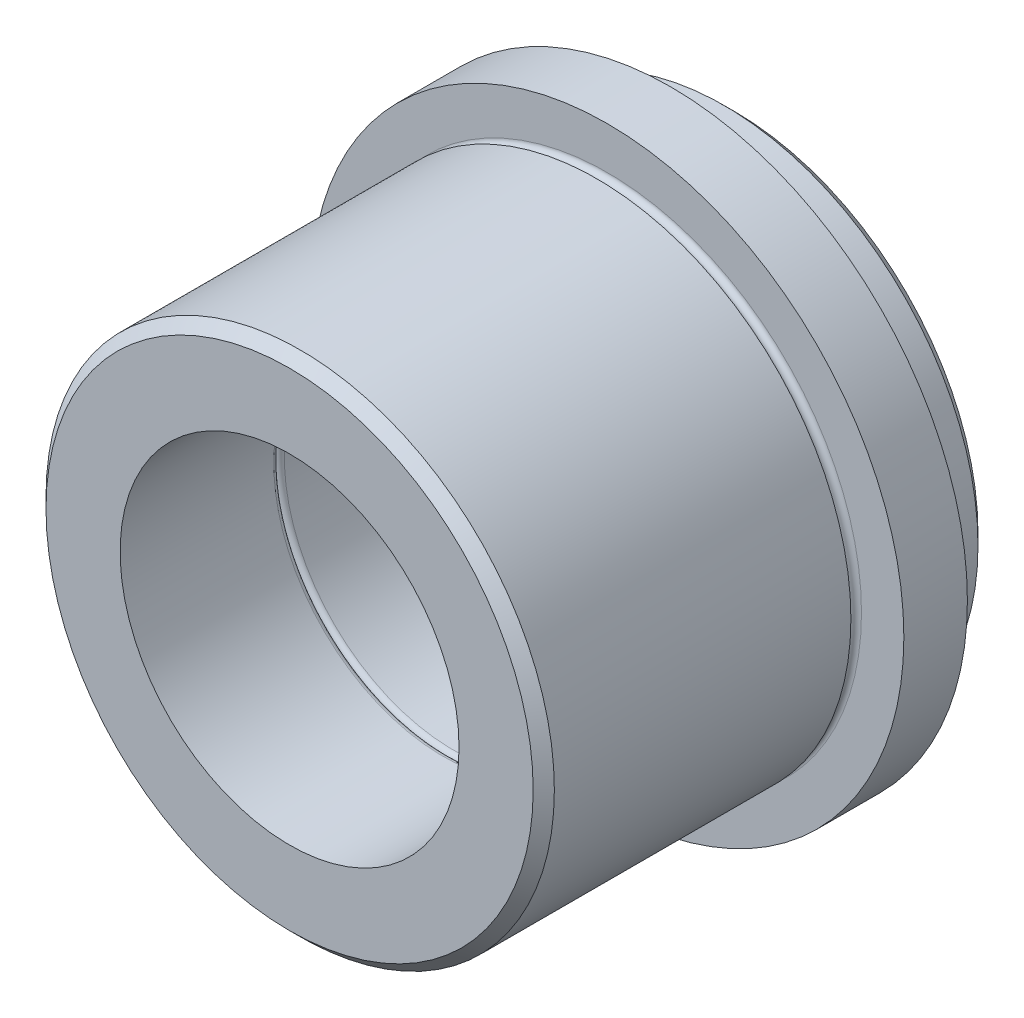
ISO-10303-21;
HEADER;
FILE_DESCRIPTION(('STEP AP214'),'2;1');
FILE_NAME('part.step','',(''),(''),'','','');
FILE_SCHEMA(('AUTOMOTIVE_DESIGN { 1 0 10303 214 1 1 1 1 }'));
ENDSEC;
DATA;
#1=APPLICATION_CONTEXT('core data for automotive mechanical design processes');
#2=APPLICATION_PROTOCOL_DEFINITION('international standard','automotive_design',2000,#1);
#3=PRODUCT_CONTEXT('',#1,'mechanical');
#4=PRODUCT('Part','Part','',(#3));
#5=PRODUCT_RELATED_PRODUCT_CATEGORY('part','',(#4));
#6=PRODUCT_DEFINITION_FORMATION('','',#4);
#7=PRODUCT_DEFINITION_CONTEXT('part definition',#1,'design');
#8=PRODUCT_DEFINITION('design','',#6,#7);
#9=PRODUCT_DEFINITION_SHAPE('','',#8);
#10=(LENGTH_UNIT() NAMED_UNIT(*) SI_UNIT(.MILLI.,.METRE.));
#11=(NAMED_UNIT(*) PLANE_ANGLE_UNIT() SI_UNIT($,.RADIAN.));
#12=(NAMED_UNIT(*) SI_UNIT($,.STERADIAN.) SOLID_ANGLE_UNIT());
#13=UNCERTAINTY_MEASURE_WITH_UNIT(LENGTH_MEASURE(1.E-05),#10,'distance_accuracy_value','');
#14=(GEOMETRIC_REPRESENTATION_CONTEXT(3) GLOBAL_UNCERTAINTY_ASSIGNED_CONTEXT((#13)) GLOBAL_UNIT_ASSIGNED_CONTEXT((#10,
#11,#12)) REPRESENTATION_CONTEXT('',''));
#15=CARTESIAN_POINT('',(0.,0.,0.));
#16=DIRECTION('',(0.,0.,1.));
#17=DIRECTION('',(1.,0.,0.));
#18=AXIS2_PLACEMENT_3D('',#15,#16,#17);
#19=CARTESIAN_POINT('',(0.,0.,0.));
#20=DIRECTION('',(0.,0.,1.));
#21=DIRECTION('',(1.,0.,0.));
#22=AXIS2_PLACEMENT_3D('',#19,#20,#21);
#23=CYLINDRICAL_SURFACE('',#22,16.);
#24=CARTESIAN_POINT('',(0.,0.,-14.5));
#25=DIRECTION('',(0.,0.,1.));
#26=DIRECTION('',(1.,0.,0.));
#27=AXIS2_PLACEMENT_3D('',#24,#25,#26);
#28=CIRCLE('',#27,16.);
#29=CARTESIAN_POINT('',(16.,0.,-14.5));
#30=VERTEX_POINT('',#29);
#31=EDGE_CURVE('E69',#30,#30,#28,.T.);
#32=ORIENTED_EDGE('',*,*,#31,.F.);
#33=EDGE_LOOP('',(#32));
#34=FACE_BOUND('',#33,.T.);
#35=CARTESIAN_POINT('',(0.,0.,0.));
#36=DIRECTION('',(0.,0.,1.));
#37=DIRECTION('',(1.,0.,0.));
#38=AXIS2_PLACEMENT_3D('',#35,#36,#37);
#39=CIRCLE('',#38,16.);
#40=CARTESIAN_POINT('',(16.,0.,0.));
#41=VERTEX_POINT('',#40);
#42=EDGE_CURVE('E33',#41,#41,#39,.T.);
#43=ORIENTED_EDGE('',*,*,#42,.T.);
#44=EDGE_LOOP('',(#43));
#45=FACE_BOUND('',#44,.T.);
#46=ADVANCED_FACE('F13',(#34,#45),#23,.F.);
#47=CARTESIAN_POINT('',(0.,16.,0.));
#48=DIRECTION('',(0.,0.,-1.));
#49=DIRECTION('',(-1.,0.,0.));
#50=AXIS2_PLACEMENT_3D('',#47,#48,#49);
#51=PLANE('',#50);
#52=CARTESIAN_POINT('',(0.,0.,0.));
#53=DIRECTION('',(0.,0.,-1.));
#54=DIRECTION('',(-1.,0.,0.));
#55=AXIS2_PLACEMENT_3D('',#52,#53,#54);
#56=CIRCLE('',#55,23.);
#57=CARTESIAN_POINT('',(-23.,0.,0.));
#58=VERTEX_POINT('',#57);
#59=EDGE_CURVE('E20',#58,#58,#56,.F.);
#60=ORIENTED_EDGE('',*,*,#59,.T.);
#61=EDGE_LOOP('',(#60));
#62=FACE_BOUND('',#61,.T.);
#63=ORIENTED_EDGE('',*,*,#42,.F.);
#64=EDGE_LOOP('',(#63));
#65=FACE_BOUND('',#64,.T.);
#66=ADVANCED_FACE('F77',(#62,#65),#51,.F.);
#67=CARTESIAN_POINT('',(0.,0.,0.));
#68=DIRECTION('',(0.,0.,1.));
#69=DIRECTION('',(1.,0.,0.));
#70=AXIS2_PLACEMENT_3D('',#67,#68,#69);
#71=CYLINDRICAL_SURFACE('',#70,24.);
#72=CARTESIAN_POINT('',(0.,0.,-1.));
#73=DIRECTION('',(0.,0.,-1.));
#74=DIRECTION('',(-1.,0.,0.));
#75=AXIS2_PLACEMENT_3D('',#72,#73,#74);
#76=CIRCLE('',#75,24.);
#77=CARTESIAN_POINT('',(-24.,0.,-1.));
#78=VERTEX_POINT('',#77);
#79=EDGE_CURVE('E8',#78,#78,#76,.T.);
#80=ORIENTED_EDGE('',*,*,#79,.T.);
#81=EDGE_LOOP('',(#80));
#82=FACE_BOUND('',#81,.T.);
#83=CARTESIAN_POINT('',(0.,0.,-29.));
#84=DIRECTION('',(0.,0.,1.));
#85=DIRECTION('',(1.,0.,0.));
#86=AXIS2_PLACEMENT_3D('',#83,#84,#85);
#87=CIRCLE('',#86,24.);
#88=CARTESIAN_POINT('',(24.,0.,-29.));
#89=VERTEX_POINT('',#88);
#90=EDGE_CURVE('E36',#89,#89,#87,.T.);
#91=ORIENTED_EDGE('',*,*,#90,.T.);
#92=EDGE_LOOP('',(#91));
#93=FACE_BOUND('',#92,.T.);
#94=ADVANCED_FACE('F82',(#82,#93),#71,.T.);
#95=CARTESIAN_POINT('',(0.,0.,-29.5));
#96=DIRECTION('',(0.,0.,1.));
#97=DIRECTION('',(1.,0.,0.));
#98=AXIS2_PLACEMENT_3D('',#95,#96,#97);
#99=TOROIDAL_SURFACE('',#98,24.,0.5);
#100=ORIENTED_EDGE('',*,*,#90,.F.);
#101=EDGE_LOOP('',(#100));
#102=FACE_BOUND('',#101,.T.);
#103=CARTESIAN_POINT('',(0.,0.,-30.));
#104=DIRECTION('',(0.,0.,1.));
#105=DIRECTION('',(1.,0.,0.));
#106=AXIS2_PLACEMENT_3D('',#103,#104,#105);
#107=CIRCLE('',#106,24.);
#108=CARTESIAN_POINT('',(24.,0.,-30.));
#109=VERTEX_POINT('',#108);
#110=EDGE_CURVE('E39',#109,#109,#107,.T.);
#111=ORIENTED_EDGE('',*,*,#110,.T.);
#112=EDGE_LOOP('',(#111));
#113=FACE_BOUND('',#112,.T.);
#114=ADVANCED_FACE('F89',(#102,#113),#99,.F.);
#115=CARTESIAN_POINT('',(0.,24.,-30.));
#116=DIRECTION('',(0.,0.,-1.));
#117=DIRECTION('',(-1.,0.,0.));
#118=AXIS2_PLACEMENT_3D('',#115,#116,#117);
#119=PLANE('',#118);
#120=ORIENTED_EDGE('',*,*,#110,.F.);
#121=EDGE_LOOP('',(#120));
#122=FACE_BOUND('',#121,.T.);
#123=CARTESIAN_POINT('',(0.,0.,-30.));
#124=DIRECTION('',(0.,0.,1.));
#125=DIRECTION('',(1.,0.,0.));
#126=AXIS2_PLACEMENT_3D('',#123,#124,#125);
#127=CIRCLE('',#126,28.);
#128=CARTESIAN_POINT('',(28.,0.,-30.));
#129=VERTEX_POINT('',#128);
#130=EDGE_CURVE('E42',#129,#129,#127,.T.);
#131=ORIENTED_EDGE('',*,*,#130,.T.);
#132=EDGE_LOOP('',(#131));
#133=FACE_BOUND('',#132,.T.);
#134=ADVANCED_FACE('F124',(#122,#133),#119,.F.);
#135=CARTESIAN_POINT('',(0.,0.,0.));
#136=DIRECTION('',(0.,0.,1.));
#137=DIRECTION('',(1.,0.,0.));
#138=AXIS2_PLACEMENT_3D('',#135,#136,#137);
#139=CYLINDRICAL_SURFACE('',#138,28.);
#140=ORIENTED_EDGE('',*,*,#130,.F.);
#141=EDGE_LOOP('',(#140));
#142=FACE_BOUND('',#141,.T.);
#143=CARTESIAN_POINT('',(0.,0.,-36.));
#144=DIRECTION('',(0.,0.,1.));
#145=DIRECTION('',(1.,0.,0.));
#146=AXIS2_PLACEMENT_3D('',#143,#144,#145);
#147=CIRCLE('',#146,28.);
#148=CARTESIAN_POINT('',(28.,0.,-36.));
#149=VERTEX_POINT('',#148);
#150=EDGE_CURVE('E45',#149,#149,#147,.T.);
#151=ORIENTED_EDGE('',*,*,#150,.T.);
#152=EDGE_LOOP('',(#151));
#153=FACE_BOUND('',#152,.T.);
#154=ADVANCED_FACE('F117',(#142,#153),#139,.T.);
#155=CARTESIAN_POINT('',(0.,28.,-36.));
#156=DIRECTION('',(0.,0.,1.));
#157=DIRECTION('',(1.,0.,0.));
#158=AXIS2_PLACEMENT_3D('',#155,#156,#157);
#159=PLANE('',#158);
#160=ORIENTED_EDGE('',*,*,#150,.F.);
#161=EDGE_LOOP('',(#160));
#162=FACE_BOUND('',#161,.T.);
#163=CARTESIAN_POINT('',(0.,0.,-36.));
#164=DIRECTION('',(0.,0.,1.));
#165=DIRECTION('',(1.,0.,0.));
#166=AXIS2_PLACEMENT_3D('',#163,#164,#165);
#167=CIRCLE('',#166,24.);
#168=CARTESIAN_POINT('',(24.,0.,-36.));
#169=VERTEX_POINT('',#168);
#170=EDGE_CURVE('E48',#169,#169,#167,.T.);
#171=ORIENTED_EDGE('',*,*,#170,.T.);
#172=EDGE_LOOP('',(#171));
#173=FACE_BOUND('',#172,.T.);
#174=ADVANCED_FACE('F112',(#162,#173),#159,.F.);
#175=CARTESIAN_POINT('',(0.,0.,0.));
#176=DIRECTION('',(0.,0.,1.));
#177=DIRECTION('',(1.,0.,0.));
#178=AXIS2_PLACEMENT_3D('',#175,#176,#177);
#179=CYLINDRICAL_SURFACE('',#178,24.);
#180=CARTESIAN_POINT('',(0.,0.,-41.));
#181=DIRECTION('',(0.,0.,1.));
#182=DIRECTION('',(1.,0.,0.));
#183=AXIS2_PLACEMENT_3D('',#180,#181,#182);
#184=CIRCLE('',#183,24.);
#185=CARTESIAN_POINT('',(24.,0.,-41.));
#186=VERTEX_POINT('',#185);
#187=EDGE_CURVE('E28',#186,#186,#184,.T.);
#188=ORIENTED_EDGE('',*,*,#187,.T.);
#189=EDGE_LOOP('',(#188));
#190=FACE_BOUND('',#189,.T.);
#191=ORIENTED_EDGE('',*,*,#170,.F.);
#192=EDGE_LOOP('',(#191));
#193=FACE_BOUND('',#192,.T.);
#194=ADVANCED_FACE('F108',(#190,#193),#179,.T.);
#195=CARTESIAN_POINT('',(0.,24.,-42.));
#196=DIRECTION('',(0.,0.,1.));
#197=DIRECTION('',(1.,0.,0.));
#198=AXIS2_PLACEMENT_3D('',#195,#196,#197);
#199=PLANE('',#198);
#200=CARTESIAN_POINT('',(0.,0.,-42.));
#201=DIRECTION('',(0.,0.,1.));
#202=DIRECTION('',(1.,0.,0.));
#203=AXIS2_PLACEMENT_3D('',#200,#201,#202);
#204=CIRCLE('',#203,23.);
#205=CARTESIAN_POINT('',(23.,0.,-42.));
#206=VERTEX_POINT('',#205);
#207=EDGE_CURVE('E24',#206,#206,#204,.F.);
#208=ORIENTED_EDGE('',*,*,#207,.T.);
#209=EDGE_LOOP('',(#208));
#210=FACE_BOUND('',#209,.T.);
#211=CARTESIAN_POINT('',(0.,0.,-42.));
#212=DIRECTION('',(0.,0.,1.));
#213=DIRECTION('',(1.,0.,0.));
#214=AXIS2_PLACEMENT_3D('',#211,#212,#213);
#215=CIRCLE('',#214,16.);
#216=CARTESIAN_POINT('',(16.,0.,-42.));
#217=VERTEX_POINT('',#216);
#218=EDGE_CURVE('E51',#217,#217,#215,.T.);
#219=ORIENTED_EDGE('',*,*,#218,.T.);
#220=EDGE_LOOP('',(#219));
#221=FACE_BOUND('',#220,.T.);
#222=ADVANCED_FACE('F111',(#210,#221),#199,.F.);
#223=CARTESIAN_POINT('',(0.,0.,0.));
#224=DIRECTION('',(0.,0.,1.));
#225=DIRECTION('',(1.,0.,0.));
#226=AXIS2_PLACEMENT_3D('',#223,#224,#225);
#227=CYLINDRICAL_SURFACE('',#226,16.);
#228=ORIENTED_EDGE('',*,*,#218,.F.);
#229=EDGE_LOOP('',(#228));
#230=FACE_BOUND('',#229,.T.);
#231=CARTESIAN_POINT('',(0.,0.,-31.5));
#232=DIRECTION('',(0.,0.,1.));
#233=DIRECTION('',(1.,0.,0.));
#234=AXIS2_PLACEMENT_3D('',#231,#232,#233);
#235=CIRCLE('',#234,16.);
#236=CARTESIAN_POINT('',(16.,0.,-31.5));
#237=VERTEX_POINT('',#236);
#238=EDGE_CURVE('E54',#237,#237,#235,.T.);
#239=ORIENTED_EDGE('',*,*,#238,.T.);
#240=EDGE_LOOP('',(#239));
#241=FACE_BOUND('',#240,.T.);
#242=ADVANCED_FACE('F240',(#230,#241),#227,.F.);
#243=CARTESIAN_POINT('',(0.,0.,-31.5));
#244=DIRECTION('',(0.,0.,1.));
#245=DIRECTION('',(1.,0.,0.));
#246=AXIS2_PLACEMENT_3D('',#243,#244,#245);
#247=TOROIDAL_SURFACE('',#246,16.5,0.5);
#248=ORIENTED_EDGE('',*,*,#238,.F.);
#249=EDGE_LOOP('',(#248));
#250=FACE_BOUND('',#249,.T.);
#251=CARTESIAN_POINT('',(0.,0.,-31.));
#252=DIRECTION('',(0.,0.,1.));
#253=DIRECTION('',(1.,0.,0.));
#254=AXIS2_PLACEMENT_3D('',#251,#252,#253);
#255=CIRCLE('',#254,16.5);
#256=CARTESIAN_POINT('',(16.5,0.,-31.));
#257=VERTEX_POINT('',#256);
#258=EDGE_CURVE('E57',#257,#257,#255,.T.);
#259=ORIENTED_EDGE('',*,*,#258,.T.);
#260=EDGE_LOOP('',(#259));
#261=FACE_BOUND('',#260,.T.);
#262=ADVANCED_FACE('F231',(#250,#261),#247,.T.);
#263=CARTESIAN_POINT('',(0.,0.,-30.5));
#264=DIRECTION('',(0.,0.,1.));
#265=DIRECTION('',(1.,0.,0.));
#266=AXIS2_PLACEMENT_3D('',#263,#264,#265);
#267=TOROIDAL_SURFACE('',#266,16.5,0.5);
#268=ORIENTED_EDGE('',*,*,#258,.F.);
#269=EDGE_LOOP('',(#268));
#270=FACE_BOUND('',#269,.T.);
#271=CARTESIAN_POINT('',(0.,0.,-30.5));
#272=DIRECTION('',(0.,0.,1.));
#273=DIRECTION('',(1.,0.,0.));
#274=AXIS2_PLACEMENT_3D('',#271,#272,#273);
#275=CIRCLE('',#274,16.);
#276=CARTESIAN_POINT('',(16.,0.,-30.5));
#277=VERTEX_POINT('',#276);
#278=EDGE_CURVE('E60',#277,#277,#275,.T.);
#279=ORIENTED_EDGE('',*,*,#278,.T.);
#280=EDGE_LOOP('',(#279));
#281=FACE_BOUND('',#280,.T.);
#282=ADVANCED_FACE('F222',(#270,#281),#267,.T.);
#283=CARTESIAN_POINT('',(0.,0.,0.));
#284=DIRECTION('',(0.,0.,1.));
#285=DIRECTION('',(1.,0.,0.));
#286=AXIS2_PLACEMENT_3D('',#283,#284,#285);
#287=CYLINDRICAL_SURFACE('',#286,16.);
#288=ORIENTED_EDGE('',*,*,#278,.F.);
#289=EDGE_LOOP('',(#288));
#290=FACE_BOUND('',#289,.T.);
#291=CARTESIAN_POINT('',(0.,0.,-15.5));
#292=DIRECTION('',(0.,0.,1.));
#293=DIRECTION('',(1.,0.,0.));
#294=AXIS2_PLACEMENT_3D('',#291,#292,#293);
#295=CIRCLE('',#294,16.);
#296=CARTESIAN_POINT('',(16.,0.,-15.5));
#297=VERTEX_POINT('',#296);
#298=EDGE_CURVE('E63',#297,#297,#295,.T.);
#299=ORIENTED_EDGE('',*,*,#298,.T.);
#300=EDGE_LOOP('',(#299));
#301=FACE_BOUND('',#300,.T.);
#302=ADVANCED_FACE('F214',(#290,#301),#287,.F.);
#303=CARTESIAN_POINT('',(0.,0.,-15.5));
#304=DIRECTION('',(0.,0.,1.));
#305=DIRECTION('',(1.,0.,0.));
#306=AXIS2_PLACEMENT_3D('',#303,#304,#305);
#307=TOROIDAL_SURFACE('',#306,16.5,0.5);
#308=ORIENTED_EDGE('',*,*,#298,.F.);
#309=EDGE_LOOP('',(#308));
#310=FACE_BOUND('',#309,.T.);
#311=CARTESIAN_POINT('',(0.,0.,-15.));
#312=DIRECTION('',(0.,0.,1.));
#313=DIRECTION('',(1.,0.,0.));
#314=AXIS2_PLACEMENT_3D('',#311,#312,#313);
#315=CIRCLE('',#314,16.5);
#316=CARTESIAN_POINT('',(16.5,0.,-15.));
#317=VERTEX_POINT('',#316);
#318=EDGE_CURVE('E66',#317,#317,#315,.T.);
#319=ORIENTED_EDGE('',*,*,#318,.T.);
#320=EDGE_LOOP('',(#319));
#321=FACE_BOUND('',#320,.T.);
#322=ADVANCED_FACE('F101',(#310,#321),#307,.T.);
#323=CARTESIAN_POINT('',(0.,0.,-14.5));
#324=DIRECTION('',(0.,0.,1.));
#325=DIRECTION('',(1.,0.,0.));
#326=AXIS2_PLACEMENT_3D('',#323,#324,#325);
#327=TOROIDAL_SURFACE('',#326,16.5,0.5);
#328=ORIENTED_EDGE('',*,*,#318,.F.);
#329=EDGE_LOOP('',(#328));
#330=FACE_BOUND('',#329,.T.);
#331=ORIENTED_EDGE('',*,*,#31,.T.);
#332=EDGE_LOOP('',(#331));
#333=FACE_BOUND('',#332,.T.);
#334=ADVANCED_FACE('F73',(#330,#333),#327,.T.);
#335=CARTESIAN_POINT('',(0.,0.,-41.));
#336=DIRECTION('',(0.,0.,1.));
#337=DIRECTION('',(1.,0.,0.));
#338=AXIS2_PLACEMENT_3D('',#335,#336,#337);
#339=CONICAL_SURFACE('',#338,24.,0.785398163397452);
#340=ORIENTED_EDGE('',*,*,#207,.F.);
#341=EDGE_LOOP('',(#340));
#342=FACE_BOUND('',#341,.T.);
#343=ORIENTED_EDGE('',*,*,#187,.F.);
#344=EDGE_LOOP('',(#343));
#345=FACE_BOUND('',#344,.T.);
#346=ADVANCED_FACE('F92',(#342,#345),#339,.T.);
#347=CARTESIAN_POINT('',(0.,0.,0.));
#348=DIRECTION('',(0.,0.,-1.));
#349=DIRECTION('',(-1.,0.,0.));
#350=AXIS2_PLACEMENT_3D('',#347,#348,#349);
#351=CONICAL_SURFACE('',#350,23.,0.785398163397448);
#352=ORIENTED_EDGE('',*,*,#79,.F.);
#353=EDGE_LOOP('',(#352));
#354=FACE_BOUND('',#353,.T.);
#355=ORIENTED_EDGE('',*,*,#59,.F.);
#356=EDGE_LOOP('',(#355));
#357=FACE_BOUND('',#356,.T.);
#358=ADVANCED_FACE('F15',(#354,#357),#351,.T.);
#359=CLOSED_SHELL('',(#46,#66,#94,#114,#134,#154,#174,#194,#222,#242,#262,#282,#302,#322,#334,
#346,#358));
#360=MANIFOLD_SOLID_BREP('B1',#359);
#361=ADVANCED_BREP_SHAPE_REPRESENTATION('',(#18,#360),#14);
#362=SHAPE_DEFINITION_REPRESENTATION(#9,#361);
ENDSEC;
END-ISO-10303-21;
